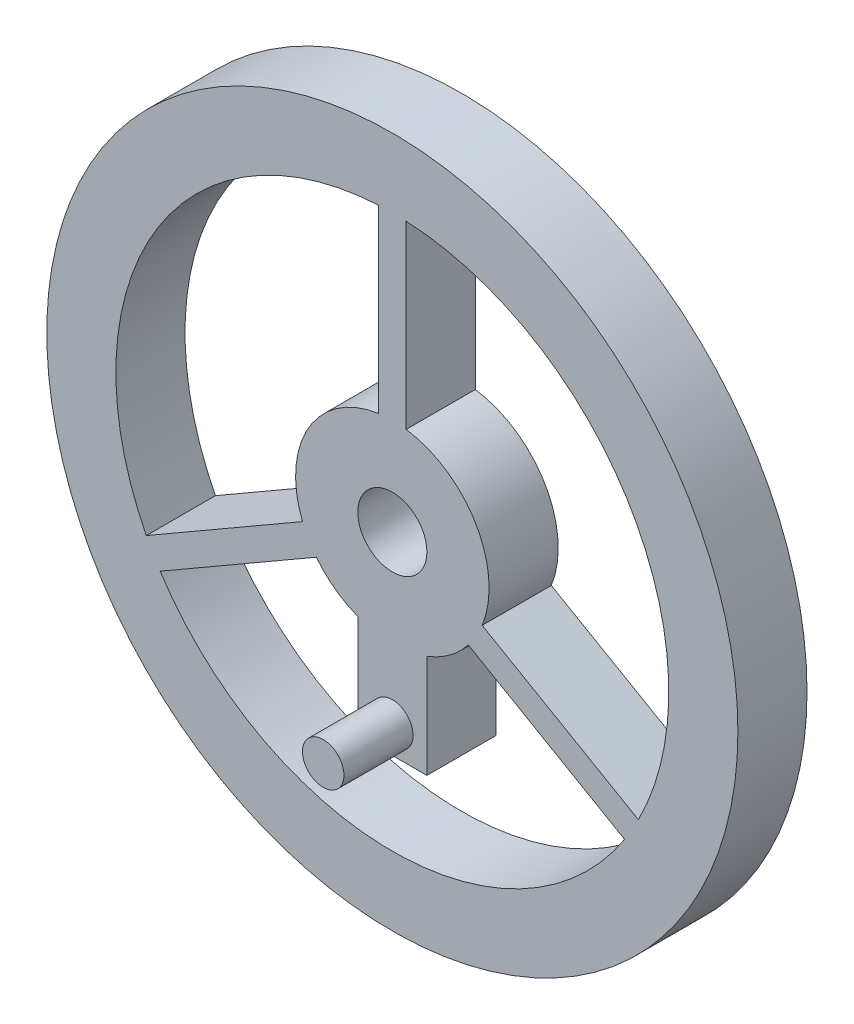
ISO-10303-21;
HEADER;
FILE_DESCRIPTION(('STEP AP214'),'2;1');
FILE_NAME('part.step','',(''),(''),'','','');
FILE_SCHEMA(('AUTOMOTIVE_DESIGN { 1 0 10303 214 1 1 1 1 }'));
ENDSEC;
DATA;
#1=APPLICATION_CONTEXT('core data for automotive mechanical design processes');
#2=APPLICATION_PROTOCOL_DEFINITION('international standard','automotive_design',2000,#1);
#3=PRODUCT_CONTEXT('',#1,'mechanical');
#4=PRODUCT('Part','Part','',(#3));
#5=PRODUCT_RELATED_PRODUCT_CATEGORY('part','',(#4));
#6=PRODUCT_DEFINITION_FORMATION('','',#4);
#7=PRODUCT_DEFINITION_CONTEXT('part definition',#1,'design');
#8=PRODUCT_DEFINITION('design','',#6,#7);
#9=PRODUCT_DEFINITION_SHAPE('','',#8);
#10=(LENGTH_UNIT() NAMED_UNIT(*) SI_UNIT(.MILLI.,.METRE.));
#11=(NAMED_UNIT(*) PLANE_ANGLE_UNIT() SI_UNIT($,.RADIAN.));
#12=(NAMED_UNIT(*) SI_UNIT($,.STERADIAN.) SOLID_ANGLE_UNIT());
#13=UNCERTAINTY_MEASURE_WITH_UNIT(LENGTH_MEASURE(1.E-05),#10,'distance_accuracy_value','');
#14=(GEOMETRIC_REPRESENTATION_CONTEXT(3) GLOBAL_UNCERTAINTY_ASSIGNED_CONTEXT((#13)) GLOBAL_UNIT_ASSIGNED_CONTEXT((#10,
#11,#12)) REPRESENTATION_CONTEXT('',''));
#15=CARTESIAN_POINT('',(0.,0.,0.));
#16=DIRECTION('',(0.,0.,1.));
#17=DIRECTION('',(1.,0.,0.));
#18=AXIS2_PLACEMENT_3D('',#15,#16,#17);
#19=CARTESIAN_POINT('',(0.,-12.,5.));
#20=DIRECTION('',(0.,0.,-1.));
#21=DIRECTION('',(-1.,0.,0.));
#22=AXIS2_PLACEMENT_3D('',#19,#20,#21);
#23=CYLINDRICAL_SURFACE('',#22,1.5);
#24=CARTESIAN_POINT('',(0.,-12.,5.));
#25=DIRECTION('',(0.,0.,1.));
#26=DIRECTION('',(1.,0.,0.));
#27=AXIS2_PLACEMENT_3D('',#24,#25,#26);
#28=CIRCLE('',#27,1.5);
#29=CARTESIAN_POINT('',(1.5,-12.,5.));
#30=VERTEX_POINT('',#29);
#31=EDGE_CURVE('E11',#30,#30,#28,.T.);
#32=ORIENTED_EDGE('',*,*,#31,.F.);
#33=EDGE_LOOP('',(#32));
#34=FACE_BOUND('',#33,.T.);
#35=CARTESIAN_POINT('',(0.,-12.,0.));
#36=DIRECTION('',(0.,0.,1.));
#37=DIRECTION('',(1.,0.,0.));
#38=AXIS2_PLACEMENT_3D('',#35,#36,#37);
#39=CIRCLE('',#38,1.5);
#40=CARTESIAN_POINT('',(1.5,-12.,0.));
#41=VERTEX_POINT('',#40);
#42=EDGE_CURVE('E45',#41,#41,#39,.T.);
#43=ORIENTED_EDGE('',*,*,#42,.T.);
#44=EDGE_LOOP('',(#43));
#45=FACE_BOUND('',#44,.T.);
#46=ADVANCED_FACE('F42',(#34,#45),#23,.T.);
#47=CARTESIAN_POINT('',(0.,0.,5.));
#48=DIRECTION('',(0.,0.,1.));
#49=DIRECTION('',(1.,0.,0.));
#50=AXIS2_PLACEMENT_3D('',#47,#48,#49);
#51=PLANE('',#50);
#52=ORIENTED_EDGE('',*,*,#31,.T.);
#53=EDGE_LOOP('',(#52));
#54=FACE_BOUND('',#53,.T.);
#55=ADVANCED_FACE('F57',(#54),#51,.T.);
#56=CARTESIAN_POINT('',(0.,0.,0.));
#57=DIRECTION('',(0.,0.,1.));
#58=DIRECTION('',(1.,0.,0.));
#59=AXIS2_PLACEMENT_3D('',#56,#57,#58);
#60=PLANE('',#59);
#61=ORIENTED_EDGE('',*,*,#42,.F.);
#62=EDGE_LOOP('',(#61));
#63=FACE_BOUND('',#62,.T.);
#64=ADVANCED_FACE('F55',(#63),#60,.F.);
#65=CLOSED_SHELL('',(#46,#55,#64));
#66=MANIFOLD_SOLID_BREP('B2',#65);
#67=CARTESIAN_POINT('',(2.5,0.,-5.));
#68=DIRECTION('',(-1.,0.,0.));
#69=DIRECTION('',(0.,-1.,0.));
#70=AXIS2_PLACEMENT_3D('',#67,#68,#69);
#71=PLANE('',#70);
#72=DIRECTION('',(0.,-1.,0.));
#73=VECTOR('',#72,1.);
#74=CARTESIAN_POINT('',(2.5,0.,0.));
#75=LINE('',#74,#73);
#76=CARTESIAN_POINT('',(2.5,-6.53834841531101,0.));
#77=VERTEX_POINT('',#76);
#78=CARTESIAN_POINT('',(2.5,-14.,0.));
#79=VERTEX_POINT('',#78);
#80=EDGE_CURVE('E262',#77,#79,#75,.T.);
#81=ORIENTED_EDGE('',*,*,#80,.T.);
#82=DIRECTION('',(0.,0.,1.));
#83=VECTOR('',#82,1.);
#84=CARTESIAN_POINT('',(2.5,-14.,-5.));
#85=LINE('',#84,#83);
#86=CARTESIAN_POINT('',(2.5,-14.,-5.));
#87=VERTEX_POINT('',#86);
#88=EDGE_CURVE('E40',#87,#79,#85,.T.);
#89=ORIENTED_EDGE('',*,*,#88,.F.);
#90=DIRECTION('',(0.,-1.,0.));
#91=VECTOR('',#90,1.);
#92=CARTESIAN_POINT('',(2.5,0.,-5.));
#93=LINE('',#92,#91);
#94=CARTESIAN_POINT('',(2.5,-6.53834841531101,-5.));
#95=VERTEX_POINT('',#94);
#96=EDGE_CURVE('E101',#95,#87,#93,.T.);
#97=ORIENTED_EDGE('',*,*,#96,.F.);
#98=DIRECTION('',(0.,0.,1.));
#99=VECTOR('',#98,1.);
#100=CARTESIAN_POINT('',(2.5,-6.53834841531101,-5.));
#101=LINE('',#100,#99);
#102=EDGE_CURVE('E291',#95,#77,#101,.T.);
#103=ORIENTED_EDGE('',*,*,#102,.T.);
#104=EDGE_LOOP('',(#81,#89,#97,#103));
#105=FACE_BOUND('',#104,.T.);
#106=ADVANCED_FACE('F82',(#105),#71,.F.);
#107=CARTESIAN_POINT('',(0.,-14.,-5.));
#108=DIRECTION('',(0.,-1.,0.));
#109=DIRECTION('',(0.,0.,-1.));
#110=AXIS2_PLACEMENT_3D('',#107,#108,#109);
#111=PLANE('',#110);
#112=DIRECTION('',(1.,0.,0.));
#113=VECTOR('',#112,1.);
#114=CARTESIAN_POINT('',(0.,-14.,0.));
#115=LINE('',#114,#113);
#116=CARTESIAN_POINT('',(-2.5,-14.,0.));
#117=VERTEX_POINT('',#116);
#118=EDGE_CURVE('E278',#117,#79,#115,.T.);
#119=ORIENTED_EDGE('',*,*,#118,.F.);
#120=DIRECTION('',(0.,0.,1.));
#121=VECTOR('',#120,1.);
#122=CARTESIAN_POINT('',(-2.5,-14.,-5.));
#123=LINE('',#122,#121);
#124=CARTESIAN_POINT('',(-2.5,-14.,-5.));
#125=VERTEX_POINT('',#124);
#126=EDGE_CURVE('E92',#125,#117,#123,.T.);
#127=ORIENTED_EDGE('',*,*,#126,.F.);
#128=DIRECTION('',(1.,0.,0.));
#129=VECTOR('',#128,1.);
#130=CARTESIAN_POINT('',(0.,-14.,-5.));
#131=LINE('',#130,#129);
#132=EDGE_CURVE('E219',#125,#87,#131,.T.);
#133=ORIENTED_EDGE('',*,*,#132,.T.);
#134=ORIENTED_EDGE('',*,*,#88,.T.);
#135=EDGE_LOOP('',(#119,#127,#133,#134));
#136=FACE_BOUND('',#135,.T.);
#137=ADVANCED_FACE('F370',(#136),#111,.T.);
#138=CARTESIAN_POINT('',(-2.5,0.,-5.));
#139=DIRECTION('',(-1.,0.,0.));
#140=DIRECTION('',(0.,-1.,0.));
#141=AXIS2_PLACEMENT_3D('',#138,#139,#140);
#142=PLANE('',#141);
#143=DIRECTION('',(0.,-1.,0.));
#144=VECTOR('',#143,1.);
#145=CARTESIAN_POINT('',(-2.5,0.,0.));
#146=LINE('',#145,#144);
#147=CARTESIAN_POINT('',(-2.5,-6.53834841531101,0.));
#148=VERTEX_POINT('',#147);
#149=EDGE_CURVE('E209',#148,#117,#146,.T.);
#150=ORIENTED_EDGE('',*,*,#149,.F.);
#151=DIRECTION('',(0.,0.,1.));
#152=VECTOR('',#151,1.);
#153=CARTESIAN_POINT('',(-2.5,-6.53834841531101,-5.));
#154=LINE('',#153,#152);
#155=CARTESIAN_POINT('',(-2.5,-6.53834841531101,-5.));
#156=VERTEX_POINT('',#155);
#157=EDGE_CURVE('E205',#156,#148,#154,.T.);
#158=ORIENTED_EDGE('',*,*,#157,.F.);
#159=DIRECTION('',(0.,-1.,0.));
#160=VECTOR('',#159,1.);
#161=CARTESIAN_POINT('',(-2.5,0.,-5.));
#162=LINE('',#161,#160);
#163=EDGE_CURVE('E208',#156,#125,#162,.T.);
#164=ORIENTED_EDGE('',*,*,#163,.T.);
#165=ORIENTED_EDGE('',*,*,#126,.T.);
#166=EDGE_LOOP('',(#150,#158,#164,#165));
#167=FACE_BOUND('',#166,.T.);
#168=ADVANCED_FACE('F207',(#167),#142,.T.);
#169=CARTESIAN_POINT('',(0.,0.,-5.));
#170=DIRECTION('',(0.,0.,1.));
#171=DIRECTION('',(1.,0.,0.));
#172=AXIS2_PLACEMENT_3D('',#169,#170,#171);
#173=CYLINDRICAL_SURFACE('',#172,7.);
#174=CARTESIAN_POINT('',(0.,0.,0.));
#175=DIRECTION('',(0.,0.,1.));
#176=DIRECTION('',(1.,0.,0.));
#177=AXIS2_PLACEMENT_3D('',#174,#175,#176);
#178=CIRCLE('',#177,7.);
#179=CARTESIAN_POINT('',(-5.50000000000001,-4.33012701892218,0.));
#180=VERTEX_POINT('',#179);
#181=EDGE_CURVE('E275',#180,#148,#178,.T.);
#182=ORIENTED_EDGE('',*,*,#181,.F.);
#183=DIRECTION('',(0.,0.,1.));
#184=VECTOR('',#183,1.);
#185=CARTESIAN_POINT('',(-5.50000000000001,-4.33012701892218,-5.));
#186=LINE('',#185,#184);
#187=CARTESIAN_POINT('',(-5.50000000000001,-4.33012701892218,-5.));
#188=VERTEX_POINT('',#187);
#189=EDGE_CURVE('E214',#188,#180,#186,.T.);
#190=ORIENTED_EDGE('',*,*,#189,.F.);
#191=CARTESIAN_POINT('',(0.,0.,-5.));
#192=DIRECTION('',(0.,0.,1.));
#193=DIRECTION('',(1.,0.,0.));
#194=AXIS2_PLACEMENT_3D('',#191,#192,#193);
#195=CIRCLE('',#194,7.);
#196=EDGE_CURVE('E218',#188,#156,#195,.T.);
#197=ORIENTED_EDGE('',*,*,#196,.T.);
#198=ORIENTED_EDGE('',*,*,#157,.T.);
#199=EDGE_LOOP('',(#182,#190,#197,#198));
#200=FACE_BOUND('',#199,.T.);
#201=ADVANCED_FACE('F221',(#200),#173,.T.);
#202=CARTESIAN_POINT('',(0.499999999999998,-0.86602540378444,-5.));
#203=DIRECTION('',(-0.499999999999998,0.86602540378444,0.));
#204=DIRECTION('',(-0.86602540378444,-0.499999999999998,0.));
#205=AXIS2_PLACEMENT_3D('',#202,#203,#204);
#206=PLANE('',#205);
#207=DIRECTION('',(-0.86602540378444,-0.499999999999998,0.));
#208=VECTOR('',#207,1.);
#209=CARTESIAN_POINT('',(0.499999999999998,-0.86602540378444,0.));
#210=LINE('',#209,#208);
#211=CARTESIAN_POINT('',(-16.7988438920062,-10.8535175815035,0.));
#212=VERTEX_POINT('',#211);
#213=EDGE_CURVE('E273',#180,#212,#210,.T.);
#214=ORIENTED_EDGE('',*,*,#213,.T.);
#215=DIRECTION('',(0.,0.,1.));
#216=VECTOR('',#215,1.);
#217=CARTESIAN_POINT('',(-16.7988438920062,-10.8535175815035,-5.));
#218=LINE('',#217,#216);
#219=CARTESIAN_POINT('',(-16.7988438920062,-10.8535175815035,-5.));
#220=VERTEX_POINT('',#219);
#221=EDGE_CURVE('E284',#220,#212,#218,.T.);
#222=ORIENTED_EDGE('',*,*,#221,.F.);
#223=DIRECTION('',(-0.86602540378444,-0.499999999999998,0.));
#224=VECTOR('',#223,1.);
#225=CARTESIAN_POINT('',(0.499999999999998,-0.86602540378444,-5.));
#226=LINE('',#225,#224);
#227=EDGE_CURVE('E223',#188,#220,#226,.T.);
#228=ORIENTED_EDGE('',*,*,#227,.F.);
#229=ORIENTED_EDGE('',*,*,#189,.T.);
#230=EDGE_LOOP('',(#214,#222,#228,#229));
#231=FACE_BOUND('',#230,.T.);
#232=ADVANCED_FACE('F374',(#231),#206,.F.);
#233=CARTESIAN_POINT('',(0.,0.,-5.));
#234=DIRECTION('',(0.,0.,1.));
#235=DIRECTION('',(1.,0.,0.));
#236=AXIS2_PLACEMENT_3D('',#233,#234,#235);
#237=CYLINDRICAL_SURFACE('',#236,20.);
#238=CARTESIAN_POINT('',(0.,0.,0.));
#239=DIRECTION('',(0.,0.,1.));
#240=DIRECTION('',(1.,0.,0.));
#241=AXIS2_PLACEMENT_3D('',#238,#239,#240);
#242=CIRCLE('',#241,20.);
#243=CARTESIAN_POINT('',(16.7988438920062,-10.8535175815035,0.));
#244=VERTEX_POINT('',#243);
#245=EDGE_CURVE('E270',#212,#244,#242,.T.);
#246=ORIENTED_EDGE('',*,*,#245,.T.);
#247=DIRECTION('',(0.,0.,1.));
#248=VECTOR('',#247,1.);
#249=CARTESIAN_POINT('',(16.7988438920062,-10.8535175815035,-5.));
#250=LINE('',#249,#248);
#251=CARTESIAN_POINT('',(16.7988438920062,-10.8535175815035,-5.));
#252=VERTEX_POINT('',#251);
#253=EDGE_CURVE('E287',#252,#244,#250,.T.);
#254=ORIENTED_EDGE('',*,*,#253,.F.);
#255=CARTESIAN_POINT('',(0.,0.,-5.));
#256=DIRECTION('',(0.,0.,1.));
#257=DIRECTION('',(1.,0.,0.));
#258=AXIS2_PLACEMENT_3D('',#255,#256,#257);
#259=CIRCLE('',#258,20.);
#260=EDGE_CURVE('E225',#220,#252,#259,.T.);
#261=ORIENTED_EDGE('',*,*,#260,.F.);
#262=ORIENTED_EDGE('',*,*,#221,.T.);
#263=EDGE_LOOP('',(#246,#254,#261,#262));
#264=FACE_BOUND('',#263,.T.);
#265=ADVANCED_FACE('F360',(#264),#237,.F.);
#266=CARTESIAN_POINT('',(-0.499999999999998,-0.866025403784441,-5.));
#267=DIRECTION('',(-0.499999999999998,-0.86602540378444,0.));
#268=DIRECTION('',(0.86602540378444,-0.499999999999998,0.));
#269=AXIS2_PLACEMENT_3D('',#266,#267,#268);
#270=PLANE('',#269);
#271=DIRECTION('',(0.86602540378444,-0.499999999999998,0.));
#272=VECTOR('',#271,1.);
#273=CARTESIAN_POINT('',(-0.499999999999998,-0.866025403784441,0.));
#274=LINE('',#273,#272);
#275=CARTESIAN_POINT('',(5.50000000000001,-4.33012701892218,0.));
#276=VERTEX_POINT('',#275);
#277=EDGE_CURVE('E267',#276,#244,#274,.T.);
#278=ORIENTED_EDGE('',*,*,#277,.F.);
#279=DIRECTION('',(0.,0.,1.));
#280=VECTOR('',#279,1.);
#281=CARTESIAN_POINT('',(5.50000000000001,-4.33012701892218,-5.));
#282=LINE('',#281,#280);
#283=CARTESIAN_POINT('',(5.50000000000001,-4.33012701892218,-5.));
#284=VERTEX_POINT('',#283);
#285=EDGE_CURVE('E289',#284,#276,#282,.T.);
#286=ORIENTED_EDGE('',*,*,#285,.F.);
#287=DIRECTION('',(0.86602540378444,-0.499999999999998,0.));
#288=VECTOR('',#287,1.);
#289=CARTESIAN_POINT('',(-0.499999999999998,-0.866025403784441,-5.));
#290=LINE('',#289,#288);
#291=EDGE_CURVE('E353',#284,#252,#290,.T.);
#292=ORIENTED_EDGE('',*,*,#291,.T.);
#293=ORIENTED_EDGE('',*,*,#253,.T.);
#294=EDGE_LOOP('',(#278,#286,#292,#293));
#295=FACE_BOUND('',#294,.T.);
#296=ADVANCED_FACE('F364',(#295),#270,.T.);
#297=CARTESIAN_POINT('',(-1.,0.,-5.));
#298=DIRECTION('',(-1.,0.,0.));
#299=DIRECTION('',(0.,-1.,0.));
#300=AXIS2_PLACEMENT_3D('',#297,#298,#299);
#301=PLANE('',#300);
#302=DIRECTION('',(0.,-1.,0.));
#303=VECTOR('',#302,1.);
#304=CARTESIAN_POINT('',(-1.,0.,0.));
#305=LINE('',#304,#303);
#306=CARTESIAN_POINT('',(-1.,19.9749843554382,0.));
#307=VERTEX_POINT('',#306);
#308=CARTESIAN_POINT('',(-1.,6.92820323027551,0.));
#309=VERTEX_POINT('',#308);
#310=EDGE_CURVE('E250',#307,#309,#305,.T.);
#311=ORIENTED_EDGE('',*,*,#310,.F.);
#312=DIRECTION('',(0.,0.,1.));
#313=VECTOR('',#312,1.);
#314=CARTESIAN_POINT('',(-1.,19.9749843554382,-5.));
#315=LINE('',#314,#313);
#316=CARTESIAN_POINT('',(-1.,19.9749843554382,-5.));
#317=VERTEX_POINT('',#316);
#318=EDGE_CURVE('E293',#317,#307,#315,.T.);
#319=ORIENTED_EDGE('',*,*,#318,.F.);
#320=DIRECTION('',(0.,-1.,0.));
#321=VECTOR('',#320,1.);
#322=CARTESIAN_POINT('',(-1.,0.,-5.));
#323=LINE('',#322,#321);
#324=CARTESIAN_POINT('',(-1.,6.92820323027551,-5.));
#325=VERTEX_POINT('',#324);
#326=EDGE_CURVE('E338',#317,#325,#323,.T.);
#327=ORIENTED_EDGE('',*,*,#326,.T.);
#328=DIRECTION('',(0.,0.,1.));
#329=VECTOR('',#328,1.);
#330=CARTESIAN_POINT('',(-1.,6.92820323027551,-5.));
#331=LINE('',#330,#329);
#332=EDGE_CURVE('E299',#325,#309,#331,.T.);
#333=ORIENTED_EDGE('',*,*,#332,.T.);
#334=EDGE_LOOP('',(#311,#319,#327,#333));
#335=FACE_BOUND('',#334,.T.);
#336=ADVANCED_FACE('F396',(#335),#301,.T.);
#337=CARTESIAN_POINT('',(0.,0.,-5.));
#338=DIRECTION('',(0.,0.,1.));
#339=DIRECTION('',(1.,0.,0.));
#340=AXIS2_PLACEMENT_3D('',#337,#338,#339);
#341=CYLINDRICAL_SURFACE('',#340,20.);
#342=CARTESIAN_POINT('',(0.,0.,0.));
#343=DIRECTION('',(0.,0.,1.));
#344=DIRECTION('',(1.,0.,0.));
#345=AXIS2_PLACEMENT_3D('',#342,#343,#344);
#346=CIRCLE('',#345,20.);
#347=CARTESIAN_POINT('',(-17.7988438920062,-9.12146677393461,0.));
#348=VERTEX_POINT('',#347);
#349=EDGE_CURVE('E259',#307,#348,#346,.T.);
#350=ORIENTED_EDGE('',*,*,#349,.T.);
#351=DIRECTION('',(0.,0.,1.));
#352=VECTOR('',#351,1.);
#353=CARTESIAN_POINT('',(-17.7988438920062,-9.12146677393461,-5.));
#354=LINE('',#353,#352);
#355=CARTESIAN_POINT('',(-17.7988438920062,-9.12146677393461,-5.));
#356=VERTEX_POINT('',#355);
#357=EDGE_CURVE('E295',#356,#348,#354,.T.);
#358=ORIENTED_EDGE('',*,*,#357,.F.);
#359=CARTESIAN_POINT('',(0.,0.,-5.));
#360=DIRECTION('',(0.,0.,1.));
#361=DIRECTION('',(1.,0.,0.));
#362=AXIS2_PLACEMENT_3D('',#359,#360,#361);
#363=CIRCLE('',#362,20.);
#364=EDGE_CURVE('E347',#317,#356,#363,.T.);
#365=ORIENTED_EDGE('',*,*,#364,.F.);
#366=ORIENTED_EDGE('',*,*,#318,.T.);
#367=EDGE_LOOP('',(#350,#358,#365,#366));
#368=FACE_BOUND('',#367,.T.);
#369=ADVANCED_FACE('F392',(#368),#341,.F.);
#370=CARTESIAN_POINT('',(-0.499999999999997,0.866025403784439,-5.));
#371=DIRECTION('',(-0.499999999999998,0.86602540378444,0.));
#372=DIRECTION('',(-0.86602540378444,-0.499999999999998,0.));
#373=AXIS2_PLACEMENT_3D('',#370,#371,#372);
#374=PLANE('',#373);
#375=DIRECTION('',(-0.86602540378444,-0.499999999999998,0.));
#376=VECTOR('',#375,1.);
#377=CARTESIAN_POINT('',(-0.499999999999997,0.866025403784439,0.));
#378=LINE('',#377,#376);
#379=CARTESIAN_POINT('',(-6.50000000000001,-2.5980762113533,0.));
#380=VERTEX_POINT('',#379);
#381=EDGE_CURVE('E256',#380,#348,#378,.T.);
#382=ORIENTED_EDGE('',*,*,#381,.F.);
#383=DIRECTION('',(0.,0.,1.));
#384=VECTOR('',#383,1.);
#385=CARTESIAN_POINT('',(-6.50000000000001,-2.5980762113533,-5.));
#386=LINE('',#385,#384);
#387=CARTESIAN_POINT('',(-6.50000000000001,-2.5980762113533,-5.));
#388=VERTEX_POINT('',#387);
#389=EDGE_CURVE('E297',#388,#380,#386,.T.);
#390=ORIENTED_EDGE('',*,*,#389,.F.);
#391=DIRECTION('',(-0.86602540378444,-0.499999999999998,0.));
#392=VECTOR('',#391,1.);
#393=CARTESIAN_POINT('',(-0.499999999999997,0.866025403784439,-5.));
#394=LINE('',#393,#392);
#395=EDGE_CURVE('E344',#388,#356,#394,.T.);
#396=ORIENTED_EDGE('',*,*,#395,.T.);
#397=ORIENTED_EDGE('',*,*,#357,.T.);
#398=EDGE_LOOP('',(#382,#390,#396,#397));
#399=FACE_BOUND('',#398,.T.);
#400=ADVANCED_FACE('F395',(#399),#374,.T.);
#401=CARTESIAN_POINT('',(0.,0.,-5.));
#402=DIRECTION('',(0.,0.,1.));
#403=DIRECTION('',(1.,0.,0.));
#404=AXIS2_PLACEMENT_3D('',#401,#402,#403);
#405=CYLINDRICAL_SURFACE('',#404,20.);
#406=CARTESIAN_POINT('',(0.,0.,0.));
#407=DIRECTION('',(0.,0.,1.));
#408=DIRECTION('',(1.,0.,0.));
#409=AXIS2_PLACEMENT_3D('',#406,#407,#408);
#410=CIRCLE('',#409,20.);
#411=CARTESIAN_POINT('',(17.7988438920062,-9.12146677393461,0.));
#412=VERTEX_POINT('',#411);
#413=CARTESIAN_POINT('',(0.999999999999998,19.9749843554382,0.));
#414=VERTEX_POINT('',#413);
#415=EDGE_CURVE('E236',#412,#414,#410,.T.);
#416=ORIENTED_EDGE('',*,*,#415,.T.);
#417=DIRECTION('',(0.,0.,1.));
#418=VECTOR('',#417,1.);
#419=CARTESIAN_POINT('',(0.999999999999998,19.9749843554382,-5.));
#420=LINE('',#419,#418);
#421=CARTESIAN_POINT('',(0.999999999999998,19.9749843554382,-5.));
#422=VERTEX_POINT('',#421);
#423=EDGE_CURVE('E301',#422,#414,#420,.T.);
#424=ORIENTED_EDGE('',*,*,#423,.F.);
#425=CARTESIAN_POINT('',(0.,0.,-5.));
#426=DIRECTION('',(0.,0.,1.));
#427=DIRECTION('',(1.,0.,0.));
#428=AXIS2_PLACEMENT_3D('',#425,#426,#427);
#429=CIRCLE('',#428,20.);
#430=CARTESIAN_POINT('',(17.7988438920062,-9.12146677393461,-5.));
#431=VERTEX_POINT('',#430);
#432=EDGE_CURVE('E314',#431,#422,#429,.T.);
#433=ORIENTED_EDGE('',*,*,#432,.F.);
#434=DIRECTION('',(0.,0.,1.));
#435=VECTOR('',#434,1.);
#436=CARTESIAN_POINT('',(17.7988438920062,-9.12146677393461,-5.));
#437=LINE('',#436,#435);
#438=EDGE_CURVE('E86',#431,#412,#437,.T.);
#439=ORIENTED_EDGE('',*,*,#438,.T.);
#440=EDGE_LOOP('',(#416,#424,#433,#439));
#441=FACE_BOUND('',#440,.T.);
#442=ADVANCED_FACE('F312',(#441),#405,.F.);
#443=CARTESIAN_POINT('',(1.,0.,-5.));
#444=DIRECTION('',(-1.,0.,0.));
#445=DIRECTION('',(0.,-1.,0.));
#446=AXIS2_PLACEMENT_3D('',#443,#444,#445);
#447=PLANE('',#446);
#448=DIRECTION('',(0.,-1.,0.));
#449=VECTOR('',#448,1.);
#450=CARTESIAN_POINT('',(1.,0.,0.));
#451=LINE('',#450,#449);
#452=CARTESIAN_POINT('',(0.999999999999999,6.92820323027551,0.));
#453=VERTEX_POINT('',#452);
#454=EDGE_CURVE('E244',#414,#453,#451,.T.);
#455=ORIENTED_EDGE('',*,*,#454,.T.);
#456=DIRECTION('',(0.,0.,1.));
#457=VECTOR('',#456,1.);
#458=CARTESIAN_POINT('',(0.999999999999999,6.92820323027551,-5.));
#459=LINE('',#458,#457);
#460=CARTESIAN_POINT('',(0.999999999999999,6.92820323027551,-5.));
#461=VERTEX_POINT('',#460);
#462=EDGE_CURVE('E304',#461,#453,#459,.T.);
#463=ORIENTED_EDGE('',*,*,#462,.F.);
#464=DIRECTION('',(0.,-1.,0.));
#465=VECTOR('',#464,1.);
#466=CARTESIAN_POINT('',(1.,0.,-5.));
#467=LINE('',#466,#465);
#468=EDGE_CURVE('E322',#422,#461,#467,.T.);
#469=ORIENTED_EDGE('',*,*,#468,.F.);
#470=ORIENTED_EDGE('',*,*,#423,.T.);
#471=EDGE_LOOP('',(#455,#463,#469,#470));
#472=FACE_BOUND('',#471,.T.);
#473=ADVANCED_FACE('F321',(#472),#447,.F.);
#474=CARTESIAN_POINT('',(0.,0.,-5.));
#475=DIRECTION('',(0.,0.,1.));
#476=DIRECTION('',(1.,0.,0.));
#477=AXIS2_PLACEMENT_3D('',#474,#475,#476);
#478=CYLINDRICAL_SURFACE('',#477,7.);
#479=CARTESIAN_POINT('',(0.,0.,0.));
#480=DIRECTION('',(0.,0.,1.));
#481=DIRECTION('',(1.,0.,0.));
#482=AXIS2_PLACEMENT_3D('',#479,#480,#481);
#483=CIRCLE('',#482,7.);
#484=CARTESIAN_POINT('',(6.50000000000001,-2.5980762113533,0.));
#485=VERTEX_POINT('',#484);
#486=EDGE_CURVE('E241',#485,#453,#483,.T.);
#487=ORIENTED_EDGE('',*,*,#486,.F.);
#488=DIRECTION('',(0.,0.,1.));
#489=VECTOR('',#488,1.);
#490=CARTESIAN_POINT('',(6.50000000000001,-2.5980762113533,-5.));
#491=LINE('',#490,#489);
#492=CARTESIAN_POINT('',(6.50000000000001,-2.5980762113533,-5.));
#493=VERTEX_POINT('',#492);
#494=EDGE_CURVE('E305',#493,#485,#491,.T.);
#495=ORIENTED_EDGE('',*,*,#494,.F.);
#496=CARTESIAN_POINT('',(0.,0.,-5.));
#497=DIRECTION('',(0.,0.,1.));
#498=DIRECTION('',(1.,0.,0.));
#499=AXIS2_PLACEMENT_3D('',#496,#497,#498);
#500=CIRCLE('',#499,7.);
#501=EDGE_CURVE('E325',#493,#461,#500,.T.);
#502=ORIENTED_EDGE('',*,*,#501,.T.);
#503=ORIENTED_EDGE('',*,*,#462,.T.);
#504=EDGE_LOOP('',(#487,#495,#502,#503));
#505=FACE_BOUND('',#504,.T.);
#506=ADVANCED_FACE('F405',(#505),#478,.T.);
#507=CARTESIAN_POINT('',(0.,0.,-5.));
#508=DIRECTION('',(0.,0.,1.));
#509=DIRECTION('',(1.,0.,0.));
#510=AXIS2_PLACEMENT_3D('',#507,#508,#509);
#511=CYLINDRICAL_SURFACE('',#510,7.);
#512=CARTESIAN_POINT('',(0.,0.,0.));
#513=DIRECTION('',(0.,0.,1.));
#514=DIRECTION('',(1.,0.,0.));
#515=AXIS2_PLACEMENT_3D('',#512,#513,#514);
#516=CIRCLE('',#515,7.);
#517=EDGE_CURVE('E253',#309,#380,#516,.T.);
#518=ORIENTED_EDGE('',*,*,#517,.F.);
#519=ORIENTED_EDGE('',*,*,#332,.F.);
#520=CARTESIAN_POINT('',(0.,0.,-5.));
#521=DIRECTION('',(0.,0.,1.));
#522=DIRECTION('',(1.,0.,0.));
#523=AXIS2_PLACEMENT_3D('',#520,#521,#522);
#524=CIRCLE('',#523,7.);
#525=EDGE_CURVE('E341',#325,#388,#524,.T.);
#526=ORIENTED_EDGE('',*,*,#525,.T.);
#527=ORIENTED_EDGE('',*,*,#389,.T.);
#528=EDGE_LOOP('',(#518,#519,#526,#527));
#529=FACE_BOUND('',#528,.T.);
#530=ADVANCED_FACE('F401',(#529),#511,.T.);
#531=CARTESIAN_POINT('',(0.,0.,-5.));
#532=DIRECTION('',(0.,0.,1.));
#533=DIRECTION('',(1.,0.,0.));
#534=AXIS2_PLACEMENT_3D('',#531,#532,#533);
#535=CYLINDRICAL_SURFACE('',#534,25.);
#536=CARTESIAN_POINT('',(0.,0.,-5.));
#537=DIRECTION('',(0.,0.,1.));
#538=DIRECTION('',(1.,0.,0.));
#539=AXIS2_PLACEMENT_3D('',#536,#537,#538);
#540=CIRCLE('',#539,25.);
#541=CARTESIAN_POINT('',(25.,0.,-5.));
#542=VERTEX_POINT('',#541);
#543=EDGE_CURVE('E324',#542,#542,#540,.T.);
#544=ORIENTED_EDGE('',*,*,#543,.T.);
#545=EDGE_LOOP('',(#544));
#546=FACE_BOUND('',#545,.T.);
#547=CARTESIAN_POINT('',(0.,0.,0.));
#548=DIRECTION('',(0.,0.,1.));
#549=DIRECTION('',(1.,0.,0.));
#550=AXIS2_PLACEMENT_3D('',#547,#548,#549);
#551=CIRCLE('',#550,25.);
#552=CARTESIAN_POINT('',(25.,0.,0.));
#553=VERTEX_POINT('',#552);
#554=EDGE_CURVE('E247',#553,#553,#551,.T.);
#555=ORIENTED_EDGE('',*,*,#554,.F.);
#556=EDGE_LOOP('',(#555));
#557=FACE_BOUND('',#556,.T.);
#558=ADVANCED_FACE('F404',(#546,#557),#535,.T.);
#559=CARTESIAN_POINT('',(0.499999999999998,0.86602540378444,-5.));
#560=DIRECTION('',(-0.499999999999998,-0.86602540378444,0.));
#561=DIRECTION('',(0.86602540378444,-0.499999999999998,0.));
#562=AXIS2_PLACEMENT_3D('',#559,#560,#561);
#563=PLANE('',#562);
#564=DIRECTION('',(0.86602540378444,-0.499999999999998,0.));
#565=VECTOR('',#564,1.);
#566=CARTESIAN_POINT('',(0.499999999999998,0.86602540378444,0.));
#567=LINE('',#566,#565);
#568=EDGE_CURVE('E239',#485,#412,#567,.T.);
#569=ORIENTED_EDGE('',*,*,#568,.T.);
#570=ORIENTED_EDGE('',*,*,#438,.F.);
#571=DIRECTION('',(0.86602540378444,-0.499999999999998,0.));
#572=VECTOR('',#571,1.);
#573=CARTESIAN_POINT('',(0.499999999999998,0.86602540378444,-5.));
#574=LINE('',#573,#572);
#575=EDGE_CURVE('E167',#493,#431,#574,.T.);
#576=ORIENTED_EDGE('',*,*,#575,.F.);
#577=ORIENTED_EDGE('',*,*,#494,.T.);
#578=EDGE_LOOP('',(#569,#570,#576,#577));
#579=FACE_BOUND('',#578,.T.);
#580=ADVANCED_FACE('F412',(#579),#563,.F.);
#581=CARTESIAN_POINT('',(0.,-12.,-5.));
#582=DIRECTION('',(0.,0.,1.));
#583=DIRECTION('',(1.,0.,0.));
#584=AXIS2_PLACEMENT_3D('',#581,#582,#583);
#585=CYLINDRICAL_SURFACE('',#584,1.5);
#586=CARTESIAN_POINT('',(0.,-12.,-5.));
#587=DIRECTION('',(0.,0.,1.));
#588=DIRECTION('',(1.,0.,0.));
#589=AXIS2_PLACEMENT_3D('',#586,#587,#588);
#590=CIRCLE('',#589,1.5);
#591=CARTESIAN_POINT('',(1.5,-12.,-5.));
#592=VERTEX_POINT('',#591);
#593=EDGE_CURVE('E328',#592,#592,#590,.T.);
#594=ORIENTED_EDGE('',*,*,#593,.F.);
#595=EDGE_LOOP('',(#594));
#596=FACE_BOUND('',#595,.T.);
#597=CARTESIAN_POINT('',(0.,-12.,0.));
#598=DIRECTION('',(0.,0.,1.));
#599=DIRECTION('',(1.,0.,0.));
#600=AXIS2_PLACEMENT_3D('',#597,#598,#599);
#601=CIRCLE('',#600,1.5);
#602=CARTESIAN_POINT('',(1.5,-12.,0.));
#603=VERTEX_POINT('',#602);
#604=EDGE_CURVE('E233',#603,#603,#601,.T.);
#605=ORIENTED_EDGE('',*,*,#604,.T.);
#606=EDGE_LOOP('',(#605));
#607=FACE_BOUND('',#606,.T.);
#608=ADVANCED_FACE('F421',(#596,#607),#585,.F.);
#609=CARTESIAN_POINT('',(0.,0.,-5.));
#610=DIRECTION('',(0.,0.,1.));
#611=DIRECTION('',(1.,0.,0.));
#612=AXIS2_PLACEMENT_3D('',#609,#610,#611);
#613=CYLINDRICAL_SURFACE('',#612,2.5);
#614=CARTESIAN_POINT('',(0.,0.,-5.));
#615=DIRECTION('',(0.,0.,1.));
#616=DIRECTION('',(1.,0.,0.));
#617=AXIS2_PLACEMENT_3D('',#614,#615,#616);
#618=CIRCLE('',#617,2.5);
#619=CARTESIAN_POINT('',(2.5,0.,-5.));
#620=VERTEX_POINT('',#619);
#621=EDGE_CURVE('E280',#620,#620,#618,.T.);
#622=ORIENTED_EDGE('',*,*,#621,.F.);
#623=EDGE_LOOP('',(#622));
#624=FACE_BOUND('',#623,.T.);
#625=CARTESIAN_POINT('',(0.,0.,0.));
#626=DIRECTION('',(0.,0.,1.));
#627=DIRECTION('',(1.,0.,0.));
#628=AXIS2_PLACEMENT_3D('',#625,#626,#627);
#629=CIRCLE('',#628,2.5);
#630=CARTESIAN_POINT('',(2.5,0.,0.));
#631=VERTEX_POINT('',#630);
#632=EDGE_CURVE('E230',#631,#631,#629,.T.);
#633=ORIENTED_EDGE('',*,*,#632,.T.);
#634=EDGE_LOOP('',(#633));
#635=FACE_BOUND('',#634,.T.);
#636=ADVANCED_FACE('F84',(#624,#635),#613,.F.);
#637=CARTESIAN_POINT('',(0.,0.,-5.));
#638=DIRECTION('',(0.,0.,1.));
#639=DIRECTION('',(1.,0.,0.));
#640=AXIS2_PLACEMENT_3D('',#637,#638,#639);
#641=CYLINDRICAL_SURFACE('',#640,7.);
#642=CARTESIAN_POINT('',(0.,0.,0.));
#643=DIRECTION('',(0.,0.,1.));
#644=DIRECTION('',(1.,0.,0.));
#645=AXIS2_PLACEMENT_3D('',#642,#643,#644);
#646=CIRCLE('',#645,7.);
#647=EDGE_CURVE('E264',#77,#276,#646,.T.);
#648=ORIENTED_EDGE('',*,*,#647,.F.);
#649=ORIENTED_EDGE('',*,*,#102,.F.);
#650=CARTESIAN_POINT('',(0.,0.,-5.));
#651=DIRECTION('',(0.,0.,1.));
#652=DIRECTION('',(1.,0.,0.));
#653=AXIS2_PLACEMENT_3D('',#650,#651,#652);
#654=CIRCLE('',#653,7.);
#655=EDGE_CURVE('E350',#95,#284,#654,.T.);
#656=ORIENTED_EDGE('',*,*,#655,.T.);
#657=ORIENTED_EDGE('',*,*,#285,.T.);
#658=EDGE_LOOP('',(#648,#649,#656,#657));
#659=FACE_BOUND('',#658,.T.);
#660=ADVANCED_FACE('F367',(#659),#641,.T.);
#661=CARTESIAN_POINT('',(0.,0.,-5.));
#662=DIRECTION('',(0.,0.,1.));
#663=DIRECTION('',(1.,0.,0.));
#664=AXIS2_PLACEMENT_3D('',#661,#662,#663);
#665=PLANE('',#664);
#666=ORIENTED_EDGE('',*,*,#621,.T.);
#667=EDGE_LOOP('',(#666));
#668=FACE_BOUND('',#667,.T.);
#669=ORIENTED_EDGE('',*,*,#593,.T.);
#670=EDGE_LOOP('',(#669));
#671=FACE_BOUND('',#670,.T.);
#672=ORIENTED_EDGE('',*,*,#432,.T.);
#673=ORIENTED_EDGE('',*,*,#468,.T.);
#674=ORIENTED_EDGE('',*,*,#501,.F.);
#675=ORIENTED_EDGE('',*,*,#575,.T.);
#676=EDGE_LOOP('',(#672,#673,#674,#675));
#677=FACE_BOUND('',#676,.T.);
#678=ORIENTED_EDGE('',*,*,#543,.F.);
#679=EDGE_LOOP('',(#678));
#680=FACE_BOUND('',#679,.T.);
#681=ORIENTED_EDGE('',*,*,#326,.F.);
#682=ORIENTED_EDGE('',*,*,#364,.T.);
#683=ORIENTED_EDGE('',*,*,#395,.F.);
#684=ORIENTED_EDGE('',*,*,#525,.F.);
#685=EDGE_LOOP('',(#681,#682,#683,#684));
#686=FACE_BOUND('',#685,.T.);
#687=ORIENTED_EDGE('',*,*,#96,.T.);
#688=ORIENTED_EDGE('',*,*,#132,.F.);
#689=ORIENTED_EDGE('',*,*,#163,.F.);
#690=ORIENTED_EDGE('',*,*,#196,.F.);
#691=ORIENTED_EDGE('',*,*,#227,.T.);
#692=ORIENTED_EDGE('',*,*,#260,.T.);
#693=ORIENTED_EDGE('',*,*,#291,.F.);
#694=ORIENTED_EDGE('',*,*,#655,.F.);
#695=EDGE_LOOP('',(#687,#688,#689,#690,#691,#692,#693,#694));
#696=FACE_BOUND('',#695,.T.);
#697=ADVANCED_FACE('F217',(#668,#671,#677,#680,#686,#696),#665,.F.);
#698=CARTESIAN_POINT('',(0.,0.,0.));
#699=DIRECTION('',(0.,0.,1.));
#700=DIRECTION('',(1.,0.,0.));
#701=AXIS2_PLACEMENT_3D('',#698,#699,#700);
#702=PLANE('',#701);
#703=ORIENTED_EDGE('',*,*,#632,.F.);
#704=EDGE_LOOP('',(#703));
#705=FACE_BOUND('',#704,.T.);
#706=ORIENTED_EDGE('',*,*,#604,.F.);
#707=EDGE_LOOP('',(#706));
#708=FACE_BOUND('',#707,.T.);
#709=ORIENTED_EDGE('',*,*,#415,.F.);
#710=ORIENTED_EDGE('',*,*,#568,.F.);
#711=ORIENTED_EDGE('',*,*,#486,.T.);
#712=ORIENTED_EDGE('',*,*,#454,.F.);
#713=EDGE_LOOP('',(#709,#710,#711,#712));
#714=FACE_BOUND('',#713,.T.);
#715=ORIENTED_EDGE('',*,*,#554,.T.);
#716=EDGE_LOOP('',(#715));
#717=FACE_BOUND('',#716,.T.);
#718=ORIENTED_EDGE('',*,*,#310,.T.);
#719=ORIENTED_EDGE('',*,*,#517,.T.);
#720=ORIENTED_EDGE('',*,*,#381,.T.);
#721=ORIENTED_EDGE('',*,*,#349,.F.);
#722=EDGE_LOOP('',(#718,#719,#720,#721));
#723=FACE_BOUND('',#722,.T.);
#724=ORIENTED_EDGE('',*,*,#80,.F.);
#725=ORIENTED_EDGE('',*,*,#647,.T.);
#726=ORIENTED_EDGE('',*,*,#277,.T.);
#727=ORIENTED_EDGE('',*,*,#245,.F.);
#728=ORIENTED_EDGE('',*,*,#213,.F.);
#729=ORIENTED_EDGE('',*,*,#181,.T.);
#730=ORIENTED_EDGE('',*,*,#149,.T.);
#731=ORIENTED_EDGE('',*,*,#118,.T.);
#732=EDGE_LOOP('',(#724,#725,#726,#727,#728,#729,#730,#731));
#733=FACE_BOUND('',#732,.T.);
#734=ADVANCED_FACE('F316',(#705,#708,#714,#717,#723,#733),#702,.T.);
#735=CLOSED_SHELL('',(#106,#137,#168,#201,#232,#265,#296,#336,#369,#400,#442,#473,#506,#530,
#558,#580,#608,#636,#660,#697,#734));
#736=MANIFOLD_SOLID_BREP('B6',#735);
#737=ADVANCED_BREP_SHAPE_REPRESENTATION('',(#18,#66,#736),#14);
#738=SHAPE_DEFINITION_REPRESENTATION(#9,#737);
ENDSEC;
END-ISO-10303-21;
